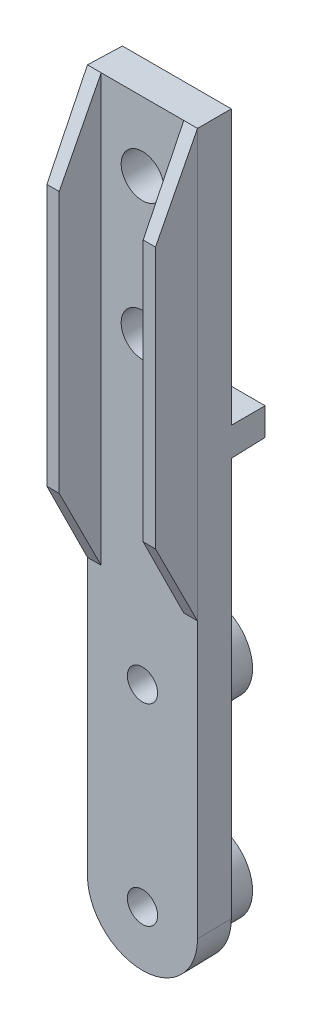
ISO-10303-21;
HEADER;
FILE_DESCRIPTION(('STEP AP214'),'2;1');
FILE_NAME('part.step','',(''),(''),'','','');
FILE_SCHEMA(('AUTOMOTIVE_DESIGN { 1 0 10303 214 1 1 1 1 }'));
ENDSEC;
DATA;
#1=APPLICATION_CONTEXT('core data for automotive mechanical design processes');
#2=APPLICATION_PROTOCOL_DEFINITION('international standard','automotive_design',2000,#1);
#3=PRODUCT_CONTEXT('',#1,'mechanical');
#4=PRODUCT('Part','Part','',(#3));
#5=PRODUCT_RELATED_PRODUCT_CATEGORY('part','',(#4));
#6=PRODUCT_DEFINITION_FORMATION('','',#4);
#7=PRODUCT_DEFINITION_CONTEXT('part definition',#1,'design');
#8=PRODUCT_DEFINITION('design','',#6,#7);
#9=PRODUCT_DEFINITION_SHAPE('','',#8);
#10=(LENGTH_UNIT() NAMED_UNIT(*) SI_UNIT(.MILLI.,.METRE.));
#11=(NAMED_UNIT(*) PLANE_ANGLE_UNIT() SI_UNIT($,.RADIAN.));
#12=(NAMED_UNIT(*) SI_UNIT($,.STERADIAN.) SOLID_ANGLE_UNIT());
#13=UNCERTAINTY_MEASURE_WITH_UNIT(LENGTH_MEASURE(1.E-05),#10,'distance_accuracy_value','');
#14=(GEOMETRIC_REPRESENTATION_CONTEXT(3) GLOBAL_UNCERTAINTY_ASSIGNED_CONTEXT((#13)) GLOBAL_UNIT_ASSIGNED_CONTEXT((#10,
#11,#12)) REPRESENTATION_CONTEXT('',''));
#15=CARTESIAN_POINT('',(0.,0.,0.));
#16=DIRECTION('',(0.,0.,1.));
#17=DIRECTION('',(1.,0.,0.));
#18=AXIS2_PLACEMENT_3D('',#15,#16,#17);
#19=CARTESIAN_POINT('',(18.9249,122.024306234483,0.));
#20=DIRECTION('',(0.,0.,-1.));
#21=DIRECTION('',(0.,1.,0.));
#22=AXIS2_PLACEMENT_3D('',#19,#20,#21);
#23=PLANE('',#22);
#24=CARTESIAN_POINT('',(14.925,107.024681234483,0.));
#25=DIRECTION('',(0.,0.,1.));
#26=DIRECTION('',(-1.,0.,0.));
#27=AXIS2_PLACEMENT_3D('',#24,#25,#26);
#28=CIRCLE('',#27,1.54996125);
#29=CARTESIAN_POINT('',(13.37503875,107.024681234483,0.));
#30=VERTEX_POINT('',#29);
#31=EDGE_CURVE('E320',#30,#30,#28,.T.);
#32=ORIENTED_EDGE('',*,*,#31,.F.);
#33=EDGE_LOOP('',(#32));
#34=FACE_BOUND('',#33,.T.);
#35=CARTESIAN_POINT('',(14.925,117.024431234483,0.));
#36=DIRECTION('',(0.,0.,1.));
#37=DIRECTION('',(-1.,0.,0.));
#38=AXIS2_PLACEMENT_3D('',#35,#36,#37);
#39=CIRCLE('',#38,1.54996125);
#40=CARTESIAN_POINT('',(13.37503875,117.024431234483,0.));
#41=VERTEX_POINT('',#40);
#42=EDGE_CURVE('E328',#41,#41,#39,.T.);
#43=ORIENTED_EDGE('',*,*,#42,.F.);
#44=EDGE_LOOP('',(#43));
#45=FACE_BOUND('',#44,.T.);
#46=CARTESIAN_POINT('',(14.925,85.0252312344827,0.));
#47=DIRECTION('',(0.,0.,1.));
#48=DIRECTION('',(1.,0.,0.));
#49=AXIS2_PLACEMENT_3D('',#46,#47,#48);
#50=CIRCLE('',#49,1.0999725);
#51=CARTESIAN_POINT('',(16.0249725,85.0252312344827,0.));
#52=VERTEX_POINT('',#51);
#53=EDGE_CURVE('E316',#52,#52,#50,.T.);
#54=ORIENTED_EDGE('',*,*,#53,.F.);
#55=EDGE_LOOP('',(#54));
#56=FACE_BOUND('',#55,.T.);
#57=CARTESIAN_POINT('',(14.925,71.0255812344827,0.));
#58=DIRECTION('',(0.,0.,1.));
#59=DIRECTION('',(1.,0.,0.));
#60=AXIS2_PLACEMENT_3D('',#57,#58,#59);
#61=CIRCLE('',#60,1.0999725);
#62=CARTESIAN_POINT('',(16.0249725,71.0255812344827,0.));
#63=VERTEX_POINT('',#62);
#64=EDGE_CURVE('E308',#63,#63,#61,.T.);
#65=ORIENTED_EDGE('',*,*,#64,.F.);
#66=EDGE_LOOP('',(#65));
#67=FACE_BOUND('',#66,.T.);
#68=DIRECTION('',(0.,-1.,0.));
#69=VECTOR('',#68,1.);
#70=CARTESIAN_POINT('',(11.925075,94.525,0.));
#71=LINE('',#70,#69);
#72=CARTESIAN_POINT('',(11.925075,91.0250812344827,0.));
#73=VERTEX_POINT('',#72);
#74=CARTESIAN_POINT('',(11.925075,122.024306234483,0.));
#75=VERTEX_POINT('',#74);
#76=EDGE_CURVE('E36',#73,#75,#71,.F.);
#77=ORIENTED_EDGE('',*,*,#76,.F.);
#78=DIRECTION('',(1.,0.,0.));
#79=VECTOR('',#78,1.);
#80=CARTESIAN_POINT('',(11.925075,91.0250812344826,0.));
#81=LINE('',#80,#79);
#82=CARTESIAN_POINT('',(10.9251,91.0250812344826,0.));
#83=VERTEX_POINT('',#82);
#84=EDGE_CURVE('E42',#83,#73,#81,.T.);
#85=ORIENTED_EDGE('',*,*,#84,.F.);
#86=DIRECTION('',(0.,1.,0.));
#87=VECTOR('',#86,1.);
#88=CARTESIAN_POINT('',(10.9251,122.024306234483,0.));
#89=LINE('',#88,#87);
#90=CARTESIAN_POINT('',(10.9251,71.0155814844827,0.));
#91=VERTEX_POINT('',#90);
#92=EDGE_CURVE('E202',#83,#91,#89,.F.);
#93=ORIENTED_EDGE('',*,*,#92,.T.);
#94=CARTESIAN_POINT('',(14.91500025,71.0155814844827,0.));
#95=DIRECTION('',(0.,0.,-1.));
#96=DIRECTION('',(0.,1.,0.));
#97=AXIS2_PLACEMENT_3D('',#94,#95,#96);
#98=CIRCLE('',#97,3.98990025);
#99=CARTESIAN_POINT('',(14.91500025,67.0256812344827,0.));
#100=VERTEX_POINT('',#99);
#101=EDGE_CURVE('E342',#91,#100,#98,.F.);
#102=ORIENTED_EDGE('',*,*,#101,.T.);
#103=DIRECTION('',(1.,0.,0.));
#104=VECTOR('',#103,1.);
#105=CARTESIAN_POINT('',(18.9249,67.0256812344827,0.));
#106=LINE('',#105,#104);
#107=CARTESIAN_POINT('',(14.93499975,67.0256812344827,0.));
#108=VERTEX_POINT('',#107);
#109=EDGE_CURVE('E362',#108,#100,#106,.F.);
#110=ORIENTED_EDGE('',*,*,#109,.F.);
#111=CARTESIAN_POINT('',(14.93499975,71.0155814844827,0.));
#112=DIRECTION('',(0.,0.,-1.));
#113=DIRECTION('',(0.,1.,0.));
#114=AXIS2_PLACEMENT_3D('',#111,#112,#113);
#115=CIRCLE('',#114,3.98990025);
#116=CARTESIAN_POINT('',(18.9249,71.0155814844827,0.));
#117=VERTEX_POINT('',#116);
#118=EDGE_CURVE('E337',#108,#117,#115,.F.);
#119=ORIENTED_EDGE('',*,*,#118,.T.);
#120=DIRECTION('',(0.,-1.,0.));
#121=VECTOR('',#120,1.);
#122=CARTESIAN_POINT('',(18.9249,122.024306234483,0.));
#123=LINE('',#122,#121);
#124=CARTESIAN_POINT('',(18.9249,91.0250812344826,0.));
#125=VERTEX_POINT('',#124);
#126=EDGE_CURVE('E352',#125,#117,#123,.T.);
#127=ORIENTED_EDGE('',*,*,#126,.F.);
#128=DIRECTION('',(1.,0.,0.));
#129=VECTOR('',#128,1.);
#130=CARTESIAN_POINT('',(17.924925,91.0250812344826,0.));
#131=LINE('',#130,#129);
#132=CARTESIAN_POINT('',(17.924925,91.0250812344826,0.));
#133=VERTEX_POINT('',#132);
#134=EDGE_CURVE('E20',#133,#125,#131,.T.);
#135=ORIENTED_EDGE('',*,*,#134,.F.);
#136=DIRECTION('',(0.,1.,0.));
#137=VECTOR('',#136,1.);
#138=CARTESIAN_POINT('',(17.924925,94.525,0.));
#139=LINE('',#138,#137);
#140=CARTESIAN_POINT('',(17.924925,122.024306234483,0.));
#141=VERTEX_POINT('',#140);
#142=EDGE_CURVE('E300',#141,#133,#139,.F.);
#143=ORIENTED_EDGE('',*,*,#142,.F.);
#144=DIRECTION('',(1.,0.,0.));
#145=VECTOR('',#144,1.);
#146=CARTESIAN_POINT('',(18.9249,122.024306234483,0.));
#147=LINE('',#146,#145);
#148=EDGE_CURVE('E396',#141,#75,#147,.F.);
#149=ORIENTED_EDGE('',*,*,#148,.T.);
#150=EDGE_LOOP('',(#77,#85,#93,#102,#110,#119,#127,#135,#143,#149));
#151=FACE_BOUND('',#150,.T.);
#152=ADVANCED_FACE('F16',(#34,#45,#56,#67,#151),#23,.F.);
#153=CARTESIAN_POINT('',(18.9249,122.024306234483,0.));
#154=DIRECTION('',(0.999847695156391,0.,-0.0174524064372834));
#155=DIRECTION('',(-0.0174524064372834,0.,-0.999847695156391));
#156=AXIS2_PLACEMENT_3D('',#153,#154,#155);
#157=PLANE('',#156);
#158=DIRECTION('',(-0.0174497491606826,-0.0174497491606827,-0.999695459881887));
#159=VECTOR('',#158,1.);
#160=CARTESIAN_POINT('',(18.9249,122.024306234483,0.));
#161=LINE('',#160,#159);
#162=CARTESIAN_POINT('',(18.881263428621,121.980669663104,-2.4999375));
#163=VERTEX_POINT('',#162);
#164=CARTESIAN_POINT('',(18.9249,122.024306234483,0.));
#165=VERTEX_POINT('',#164);
#166=EDGE_CURVE('E349',#163,#165,#161,.F.);
#167=ORIENTED_EDGE('',*,*,#166,.T.);
#168=EDGE_CURVE('E383',#165,#125,#123,.T.);
#169=ORIENTED_EDGE('',*,*,#168,.T.);
#170=ORIENTED_EDGE('',*,*,#126,.T.);
#171=DIRECTION('',(0.0174524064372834,0.,0.999847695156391));
#172=VECTOR('',#171,1.);
#173=CARTESIAN_POINT('',(18.9249,71.0155814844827,0.));
#174=LINE('',#173,#172);
#175=CARTESIAN_POINT('',(18.881263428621,71.0155814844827,-2.4999375));
#176=VERTEX_POINT('',#175);
#177=EDGE_CURVE('E367',#117,#176,#174,.F.);
#178=ORIENTED_EDGE('',*,*,#177,.T.);
#179=DIRECTION('',(0.,1.,0.));
#180=VECTOR('',#179,1.);
#181=CARTESIAN_POINT('',(18.881263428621,122.024306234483,-2.4999375));
#182=LINE('',#181,#180);
#183=CARTESIAN_POINT('',(18.881263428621,99.9812196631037,-2.4999375));
#184=VERTEX_POINT('',#183);
#185=EDGE_CURVE('E379',#176,#184,#182,.T.);
#186=ORIENTED_EDGE('',*,*,#185,.T.);
#187=DIRECTION('',(-0.0174497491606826,0.0174497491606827,-0.999695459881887));
#188=VECTOR('',#187,1.);
#189=CARTESIAN_POINT('',(18.9181747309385,99.9443083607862,-0.385290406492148));
#190=LINE('',#189,#188);
#191=CARTESIAN_POINT('',(18.837626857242,100.024856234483,-4.999875));
#192=VERTEX_POINT('',#191);
#193=EDGE_CURVE('E551',#192,#184,#190,.F.);
#194=ORIENTED_EDGE('',*,*,#193,.F.);
#195=DIRECTION('',(0.,-1.,0.));
#196=VECTOR('',#195,1.);
#197=CARTESIAN_POINT('',(18.837626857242,85.0252312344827,-4.999875));
#198=LINE('',#197,#196);
#199=CARTESIAN_POINT('',(18.837626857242,102.024806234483,-4.999875));
#200=VERTEX_POINT('',#199);
#201=EDGE_CURVE('E384',#200,#192,#198,.T.);
#202=ORIENTED_EDGE('',*,*,#201,.F.);
#203=DIRECTION('',(-0.0174497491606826,-0.0174497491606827,-0.999695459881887));
#204=VECTOR('',#203,1.);
#205=CARTESIAN_POINT('',(18.8364354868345,102.023614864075,-5.06812856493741));
#206=LINE('',#205,#204);
#207=CARTESIAN_POINT('',(18.881263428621,102.068442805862,-2.4999375));
#208=VERTEX_POINT('',#207);
#209=EDGE_CURVE('E561',#200,#208,#206,.F.);
#210=ORIENTED_EDGE('',*,*,#209,.T.);
#211=DIRECTION('',(0.,1.,0.));
#212=VECTOR('',#211,1.);
#213=CARTESIAN_POINT('',(18.881263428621,122.024306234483,-2.4999375));
#214=LINE('',#213,#212);
#215=EDGE_CURVE('E380',#208,#163,#214,.T.);
#216=ORIENTED_EDGE('',*,*,#215,.T.);
#217=EDGE_LOOP('',(#167,#169,#170,#178,#186,#194,#202,#210,#216));
#218=FACE_BOUND('',#217,.T.);
#219=ADVANCED_FACE('F886',(#218),#157,.T.);
#220=CARTESIAN_POINT('',(10.9251,122.024306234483,0.));
#221=DIRECTION('',(-0.999847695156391,0.,-0.0174524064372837));
#222=DIRECTION('',(-0.0174524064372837,0.,0.999847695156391));
#223=AXIS2_PLACEMENT_3D('',#220,#221,#222);
#224=PLANE('',#223);
#225=CARTESIAN_POINT('',(10.9251,122.024306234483,0.));
#226=VERTEX_POINT('',#225);
#227=EDGE_CURVE('E207',#226,#83,#89,.F.);
#228=ORIENTED_EDGE('',*,*,#227,.F.);
#229=DIRECTION('',(-0.0174497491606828,0.0174497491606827,0.999695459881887));
#230=VECTOR('',#229,1.);
#231=CARTESIAN_POINT('',(10.9275358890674,122.021870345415,-0.139551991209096));
#232=LINE('',#231,#230);
#233=CARTESIAN_POINT('',(10.968736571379,121.980669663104,-2.4999375));
#234=VERTEX_POINT('',#233);
#235=EDGE_CURVE('E189',#234,#226,#232,.T.);
#236=ORIENTED_EDGE('',*,*,#235,.F.);
#237=DIRECTION('',(0.,-1.,0.));
#238=VECTOR('',#237,1.);
#239=CARTESIAN_POINT('',(10.968736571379,122.024306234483,-2.4999375));
#240=LINE('',#239,#238);
#241=CARTESIAN_POINT('',(10.968736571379,102.068442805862,-2.4999375));
#242=VERTEX_POINT('',#241);
#243=EDGE_CURVE('E220',#242,#234,#240,.F.);
#244=ORIENTED_EDGE('',*,*,#243,.F.);
#245=DIRECTION('',(-0.0174497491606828,0.0174497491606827,0.999695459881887));
#246=VECTOR('',#245,1.);
#247=CARTESIAN_POINT('',(11.0135645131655,102.023614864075,-5.06812856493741));
#248=LINE('',#247,#246);
#249=CARTESIAN_POINT('',(11.012373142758,102.024806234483,-4.999875));
#250=VERTEX_POINT('',#249);
#251=EDGE_CURVE('E596',#250,#242,#248,.T.);
#252=ORIENTED_EDGE('',*,*,#251,.F.);
#253=DIRECTION('',(0.,-1.,0.));
#254=VECTOR('',#253,1.);
#255=CARTESIAN_POINT('',(11.012373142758,122.024306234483,-4.999875));
#256=LINE('',#255,#254);
#257=CARTESIAN_POINT('',(11.012373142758,100.024856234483,-4.999875));
#258=VERTEX_POINT('',#257);
#259=EDGE_CURVE('E370',#258,#250,#256,.F.);
#260=ORIENTED_EDGE('',*,*,#259,.F.);
#261=DIRECTION('',(-0.0174497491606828,-0.0174497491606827,0.999695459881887));
#262=VECTOR('',#261,1.);
#263=CARTESIAN_POINT('',(10.9318252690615,99.9443083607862,-0.385290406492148));
#264=LINE('',#263,#262);
#265=CARTESIAN_POINT('',(10.968736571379,99.9812196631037,-2.4999375));
#266=VERTEX_POINT('',#265);
#267=EDGE_CURVE('E764',#258,#266,#264,.T.);
#268=ORIENTED_EDGE('',*,*,#267,.T.);
#269=DIRECTION('',(0.,-1.,0.));
#270=VECTOR('',#269,1.);
#271=CARTESIAN_POINT('',(10.968736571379,122.024306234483,-2.4999375));
#272=LINE('',#271,#270);
#273=CARTESIAN_POINT('',(10.968736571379,71.0155814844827,-2.4999375));
#274=VERTEX_POINT('',#273);
#275=EDGE_CURVE('E353',#274,#266,#272,.F.);
#276=ORIENTED_EDGE('',*,*,#275,.F.);
#277=DIRECTION('',(-0.0174524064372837,0.,0.999847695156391));
#278=VECTOR('',#277,1.);
#279=CARTESIAN_POINT('',(10.9251,71.0155814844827,0.));
#280=LINE('',#279,#278);
#281=EDGE_CURVE('E341',#274,#91,#280,.T.);
#282=ORIENTED_EDGE('',*,*,#281,.T.);
#283=ORIENTED_EDGE('',*,*,#92,.F.);
#284=EDGE_LOOP('',(#228,#236,#244,#252,#260,#268,#276,#282,#283));
#285=FACE_BOUND('',#284,.T.);
#286=ADVANCED_FACE('F214',(#285),#224,.T.);
#287=CARTESIAN_POINT('',(18.9249,122.024306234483,-2.4999375));
#288=DIRECTION('',(0.,0.,1.));
#289=DIRECTION('',(-1.,0.,0.));
#290=AXIS2_PLACEMENT_3D('',#287,#288,#289);
#291=PLANE('',#290);
#292=CARTESIAN_POINT('',(14.925,107.024681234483,-2.4999375));
#293=DIRECTION('',(0.,0.,1.));
#294=DIRECTION('',(-1.,0.,0.));
#295=AXIS2_PLACEMENT_3D('',#292,#293,#294);
#296=CIRCLE('',#295,1.54996125);
#297=CARTESIAN_POINT('',(13.37503875,107.024681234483,-2.4999375));
#298=VERTEX_POINT('',#297);
#299=EDGE_CURVE('E324',#298,#298,#296,.T.);
#300=ORIENTED_EDGE('',*,*,#299,.T.);
#301=EDGE_LOOP('',(#300));
#302=FACE_BOUND('',#301,.T.);
#303=CARTESIAN_POINT('',(14.925,117.024431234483,-2.4999375));
#304=DIRECTION('',(0.,0.,1.));
#305=DIRECTION('',(-1.,0.,0.));
#306=AXIS2_PLACEMENT_3D('',#303,#304,#305);
#307=CIRCLE('',#306,1.54996125);
#308=CARTESIAN_POINT('',(13.37503875,117.024431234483,-2.4999375));
#309=VERTEX_POINT('',#308);
#310=EDGE_CURVE('E332',#309,#309,#307,.T.);
#311=ORIENTED_EDGE('',*,*,#310,.T.);
#312=EDGE_LOOP('',(#311));
#313=FACE_BOUND('',#312,.T.);
#314=DIRECTION('',(-1.,0.,0.));
#315=VECTOR('',#314,1.);
#316=CARTESIAN_POINT('',(18.9249,102.068442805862,-2.4999375));
#317=LINE('',#316,#315);
#318=EDGE_CURVE('E667',#242,#208,#317,.F.);
#319=ORIENTED_EDGE('',*,*,#318,.F.);
#320=ORIENTED_EDGE('',*,*,#243,.T.);
#321=DIRECTION('',(1.,0.,0.));
#322=VECTOR('',#321,1.);
#323=CARTESIAN_POINT('',(18.9249,121.980669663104,-2.4999375));
#324=LINE('',#323,#322);
#325=EDGE_CURVE('E197',#163,#234,#324,.F.);
#326=ORIENTED_EDGE('',*,*,#325,.F.);
#327=ORIENTED_EDGE('',*,*,#215,.F.);
#328=EDGE_LOOP('',(#319,#320,#326,#327));
#329=FACE_BOUND('',#328,.T.);
#330=ADVANCED_FACE('F890',(#302,#313,#329),#291,.F.);
#331=DIRECTION('',(1.,0.,0.));
#332=VECTOR('',#331,1.);
#333=CARTESIAN_POINT('',(18.9249,99.9812196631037,-2.4999375));
#334=LINE('',#333,#332);
#335=CARTESIAN_POINT('',(13.881388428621,99.9812196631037,-2.4999375));
#336=VERTEX_POINT('',#335);
#337=EDGE_CURVE('E653',#336,#266,#334,.F.);
#338=ORIENTED_EDGE('',*,*,#337,.F.);
#339=DIRECTION('',(0.,-1.,0.));
#340=VECTOR('',#339,1.);
#341=CARTESIAN_POINT('',(13.881388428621,122.024306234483,-2.4999375));
#342=LINE('',#341,#340);
#343=CARTESIAN_POINT('',(13.881388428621,87.8842768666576,-2.4999375));
#344=VERTEX_POINT('',#343);
#345=EDGE_CURVE('E11',#344,#336,#342,.F.);
#346=ORIENTED_EDGE('',*,*,#345,.F.);
#347=CARTESIAN_POINT('',(14.925,85.0252312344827,-2.4999375));
#348=DIRECTION('',(0.,0.,1.));
#349=DIRECTION('',(1.,0.,0.));
#350=AXIS2_PLACEMENT_3D('',#347,#348,#349);
#351=CIRCLE('',#350,3.04356157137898);
#352=CARTESIAN_POINT('',(13.881388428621,82.1661856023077,-2.4999375));
#353=VERTEX_POINT('',#352);
#354=EDGE_CURVE('E27',#353,#344,#351,.F.);
#355=ORIENTED_EDGE('',*,*,#354,.F.);
#356=DIRECTION('',(0.,-1.,0.));
#357=VECTOR('',#356,1.);
#358=CARTESIAN_POINT('',(13.881388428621,122.024306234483,-2.4999375));
#359=LINE('',#358,#357);
#360=CARTESIAN_POINT('',(13.881388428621,73.8846268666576,-2.4999375));
#361=VERTEX_POINT('',#360);
#362=EDGE_CURVE('E858',#361,#353,#359,.F.);
#363=ORIENTED_EDGE('',*,*,#362,.F.);
#364=CARTESIAN_POINT('',(14.925,71.0255812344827,-2.4999375));
#365=DIRECTION('',(0.,0.,1.));
#366=DIRECTION('',(1.,0.,0.));
#367=AXIS2_PLACEMENT_3D('',#364,#365,#366);
#368=CIRCLE('',#367,3.04356157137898);
#369=CARTESIAN_POINT('',(15.968611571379,73.8846268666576,-2.4999375));
#370=VERTEX_POINT('',#369);
#371=EDGE_CURVE('E867',#370,#361,#368,.F.);
#372=ORIENTED_EDGE('',*,*,#371,.F.);
#373=DIRECTION('',(0.,1.,0.));
#374=VECTOR('',#373,1.);
#375=CARTESIAN_POINT('',(15.968611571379,122.024306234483,-2.4999375));
#376=LINE('',#375,#374);
#377=CARTESIAN_POINT('',(15.968611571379,82.1661856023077,-2.4999375));
#378=VERTEX_POINT('',#377);
#379=EDGE_CURVE('E968',#378,#370,#376,.F.);
#380=ORIENTED_EDGE('',*,*,#379,.F.);
#381=CARTESIAN_POINT('',(14.925,85.0252312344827,-2.4999375));
#382=DIRECTION('',(0.,0.,1.));
#383=DIRECTION('',(1.,0.,0.));
#384=AXIS2_PLACEMENT_3D('',#381,#382,#383);
#385=CIRCLE('',#384,3.04356157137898);
#386=CARTESIAN_POINT('',(15.968611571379,87.8842768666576,-2.4999375));
#387=VERTEX_POINT('',#386);
#388=EDGE_CURVE('E972',#387,#378,#385,.F.);
#389=ORIENTED_EDGE('',*,*,#388,.F.);
#390=DIRECTION('',(0.,1.,0.));
#391=VECTOR('',#390,1.);
#392=CARTESIAN_POINT('',(15.968611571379,122.024306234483,-2.4999375));
#393=LINE('',#392,#391);
#394=CARTESIAN_POINT('',(15.968611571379,99.9812196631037,-2.4999375));
#395=VERTEX_POINT('',#394);
#396=EDGE_CURVE('E357',#395,#387,#393,.F.);
#397=ORIENTED_EDGE('',*,*,#396,.F.);
#398=DIRECTION('',(1.,0.,0.));
#399=VECTOR('',#398,1.);
#400=CARTESIAN_POINT('',(18.9249,99.9812196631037,-2.4999375));
#401=LINE('',#400,#399);
#402=EDGE_CURVE('E203',#184,#395,#401,.F.);
#403=ORIENTED_EDGE('',*,*,#402,.F.);
#404=ORIENTED_EDGE('',*,*,#185,.F.);
#405=CARTESIAN_POINT('',(14.93499975,71.0155814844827,-2.4999375));
#406=DIRECTION('',(0.,0.,1.));
#407=DIRECTION('',(1.,0.,0.));
#408=AXIS2_PLACEMENT_3D('',#405,#406,#407);
#409=CIRCLE('',#408,3.94626367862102);
#410=CARTESIAN_POINT('',(14.93499975,67.0693178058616,-2.4999375));
#411=VERTEX_POINT('',#410);
#412=EDGE_CURVE('E366',#176,#411,#409,.F.);
#413=ORIENTED_EDGE('',*,*,#412,.T.);
#414=DIRECTION('',(1.,0.,0.));
#415=VECTOR('',#414,1.);
#416=CARTESIAN_POINT('',(18.9249,67.0693178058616,-2.4999375));
#417=LINE('',#416,#415);
#418=CARTESIAN_POINT('',(14.91500025,67.0693178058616,-2.4999375));
#419=VERTEX_POINT('',#418);
#420=EDGE_CURVE('E358',#411,#419,#417,.F.);
#421=ORIENTED_EDGE('',*,*,#420,.T.);
#422=CARTESIAN_POINT('',(14.91500025,71.0155814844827,-2.4999375));
#423=DIRECTION('',(0.,0.,1.));
#424=DIRECTION('',(1.,0.,0.));
#425=AXIS2_PLACEMENT_3D('',#422,#423,#424);
#426=CIRCLE('',#425,3.94626367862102);
#427=EDGE_CURVE('E363',#419,#274,#426,.F.);
#428=ORIENTED_EDGE('',*,*,#427,.T.);
#429=ORIENTED_EDGE('',*,*,#275,.T.);
#430=EDGE_LOOP('',(#338,#346,#355,#363,#372,#380,#389,#397,#403,#404,#413,#421,#428,#429));
#431=FACE_BOUND('',#430,.T.);
#432=ADVANCED_FACE('F839',(#431),#291,.F.);
#433=CARTESIAN_POINT('',(18.9249,122.024306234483,0.));
#434=DIRECTION('',(0.,0.999847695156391,-0.0174524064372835));
#435=DIRECTION('',(0.,0.0174524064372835,0.999847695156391));
#436=AXIS2_PLACEMENT_3D('',#433,#434,#435);
#437=PLANE('',#436);
#438=ORIENTED_EDGE('',*,*,#235,.T.);
#439=DIRECTION('',(1.,0.,0.));
#440=VECTOR('',#439,1.);
#441=CARTESIAN_POINT('',(11.925075,122.024306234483,0.));
#442=LINE('',#441,#440);
#443=EDGE_CURVE('E194',#226,#75,#442,.T.);
#444=ORIENTED_EDGE('',*,*,#443,.T.);
#445=ORIENTED_EDGE('',*,*,#148,.F.);
#446=EDGE_CURVE('E484',#165,#141,#147,.F.);
#447=ORIENTED_EDGE('',*,*,#446,.F.);
#448=ORIENTED_EDGE('',*,*,#166,.F.);
#449=ORIENTED_EDGE('',*,*,#325,.T.);
#450=EDGE_LOOP('',(#438,#444,#445,#447,#448,#449));
#451=FACE_BOUND('',#450,.T.);
#452=ADVANCED_FACE('F191',(#451),#437,.T.);
#453=CARTESIAN_POINT('',(18.9249,67.0256812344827,0.));
#454=DIRECTION('',(0.,-0.999847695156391,-0.0174524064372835));
#455=DIRECTION('',(0.,0.0174524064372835,-0.999847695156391));
#456=AXIS2_PLACEMENT_3D('',#453,#454,#455);
#457=PLANE('',#456);
#458=ORIENTED_EDGE('',*,*,#420,.F.);
#459=DIRECTION('',(0.,-0.0174524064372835,0.999847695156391));
#460=VECTOR('',#459,1.);
#461=CARTESIAN_POINT('',(14.93499975,67.0256812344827,0.));
#462=LINE('',#461,#460);
#463=EDGE_CURVE('E345',#411,#108,#462,.T.);
#464=ORIENTED_EDGE('',*,*,#463,.T.);
#465=ORIENTED_EDGE('',*,*,#109,.T.);
#466=DIRECTION('',(0.,-0.0174524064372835,0.999847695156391));
#467=VECTOR('',#466,1.);
#468=CARTESIAN_POINT('',(14.91500025,67.0256812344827,0.));
#469=LINE('',#468,#467);
#470=EDGE_CURVE('E348',#100,#419,#469,.F.);
#471=ORIENTED_EDGE('',*,*,#470,.T.);
#472=EDGE_LOOP('',(#458,#464,#465,#471));
#473=FACE_BOUND('',#472,.T.);
#474=ADVANCED_FACE('F1025',(#473),#457,.T.);
#475=CARTESIAN_POINT('',(14.93499975,71.0155814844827,0.));
#476=DIRECTION('',(0.,0.,1.));
#477=DIRECTION('',(-1.,0.,0.));
#478=AXIS2_PLACEMENT_3D('',#475,#476,#477);
#479=CONICAL_SURFACE('',#478,3.98990025,0.0174532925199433);
#480=ORIENTED_EDGE('',*,*,#118,.F.);
#481=ORIENTED_EDGE('',*,*,#463,.F.);
#482=ORIENTED_EDGE('',*,*,#412,.F.);
#483=ORIENTED_EDGE('',*,*,#177,.F.);
#484=EDGE_LOOP('',(#480,#481,#482,#483));
#485=FACE_BOUND('',#484,.T.);
#486=ADVANCED_FACE('F1037',(#485),#479,.T.);
#487=CARTESIAN_POINT('',(14.91500025,71.0155814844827,0.));
#488=DIRECTION('',(0.,0.,1.));
#489=DIRECTION('',(-1.,0.,0.));
#490=AXIS2_PLACEMENT_3D('',#487,#488,#489);
#491=CONICAL_SURFACE('',#490,3.98990025,0.0174532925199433);
#492=ORIENTED_EDGE('',*,*,#101,.F.);
#493=ORIENTED_EDGE('',*,*,#281,.F.);
#494=ORIENTED_EDGE('',*,*,#427,.F.);
#495=ORIENTED_EDGE('',*,*,#470,.F.);
#496=EDGE_LOOP('',(#492,#493,#494,#495));
#497=FACE_BOUND('',#496,.T.);
#498=ADVANCED_FACE('F948',(#497),#491,.T.);
#499=CARTESIAN_POINT('',(14.925,85.0252312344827,-4.999875));
#500=DIRECTION('',(0.,0.,1.));
#501=DIRECTION('',(-1.,0.,0.));
#502=AXIS2_PLACEMENT_3D('',#499,#500,#501);
#503=CONICAL_SURFACE('',#502,2.999925,0.0174532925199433);
#504=CARTESIAN_POINT('',(15.924975,87.8535876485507,-4.999875));
#505=CARTESIAN_POINT('',(15.9322477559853,87.8587301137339,-4.5832190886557));
#506=CARTESIAN_POINT('',(15.9395205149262,87.8638587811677,-4.1665630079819));
#507=CARTESIAN_POINT('',(15.9540660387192,87.8740885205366,-3.3332505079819));
#508=CARTESIAN_POINT('',(15.9613388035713,87.8791895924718,-2.9165940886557));
#509=CARTESIAN_POINT('',(15.968611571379,87.8842768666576,-2.4999375));
#510=B_SPLINE_CURVE_WITH_KNOTS('',3,(#504,#505,#506,#507,#508,#509),.UNSPECIFIED.,.F.,.F.,(4,2,
4),(0.,1.25025332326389,2.50050664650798),.UNSPECIFIED.);
#511=CARTESIAN_POINT('',(15.924975,87.8535876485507,-4.999875));
#512=VERTEX_POINT('',#511);
#513=EDGE_CURVE('E954',#512,#387,#510,.T.);
#514=ORIENTED_EDGE('',*,*,#513,.T.);
#515=ORIENTED_EDGE('',*,*,#388,.T.);
#516=CARTESIAN_POINT('',(15.924975,82.1968748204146,-4.999875));
#517=CARTESIAN_POINT('',(15.9322477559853,82.1917323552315,-4.5832190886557));
#518=CARTESIAN_POINT('',(15.9395205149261,82.1866036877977,-4.1665630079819));
#519=CARTESIAN_POINT('',(15.9540660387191,82.1763739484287,-3.3332505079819));
#520=CARTESIAN_POINT('',(15.9613388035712,82.1712728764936,-2.9165940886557));
#521=CARTESIAN_POINT('',(15.968611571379,82.1661856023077,-2.4999375));
#522=B_SPLINE_CURVE_WITH_KNOTS('',3,(#516,#517,#518,#519,#520,#521),.UNSPECIFIED.,.F.,.F.,(4,2,
4),(0.,1.25025332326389,2.50050664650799),.UNSPECIFIED.);
#523=CARTESIAN_POINT('',(15.924975,82.1968748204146,-4.999875));
#524=VERTEX_POINT('',#523);
#525=EDGE_CURVE('E680',#524,#378,#522,.T.);
#526=ORIENTED_EDGE('',*,*,#525,.F.);
#527=CARTESIAN_POINT('',(14.925,85.0252312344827,-4.999875));
#528=DIRECTION('',(0.,0.,-1.));
#529=DIRECTION('',(1.,0.,0.));
#530=AXIS2_PLACEMENT_3D('',#527,#528,#529);
#531=CIRCLE('',#530,2.999925);
#532=EDGE_CURVE('E336',#512,#524,#531,.T.);
#533=ORIENTED_EDGE('',*,*,#532,.F.);
#534=EDGE_LOOP('',(#514,#515,#526,#533));
#535=FACE_BOUND('',#534,.T.);
#536=ADVANCED_FACE('F942',(#535),#503,.T.);
#537=CARTESIAN_POINT('',(15.924975,85.0252312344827,-4.999875));
#538=DIRECTION('',(0.999847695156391,0.,-0.0174524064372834));
#539=DIRECTION('',(-0.0174524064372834,0.,-0.999847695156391));
#540=AXIS2_PLACEMENT_3D('',#537,#538,#539);
#541=PLANE('',#540);
#542=ORIENTED_EDGE('',*,*,#525,.T.);
#543=ORIENTED_EDGE('',*,*,#379,.T.);
#544=CARTESIAN_POINT('',(15.924975,73.8539376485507,-4.999875));
#545=CARTESIAN_POINT('',(15.9322477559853,73.8590801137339,-4.5832190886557));
#546=CARTESIAN_POINT('',(15.9395205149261,73.8642087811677,-4.1665630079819));
#547=CARTESIAN_POINT('',(15.9540660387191,73.8744385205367,-3.3332505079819));
#548=CARTESIAN_POINT('',(15.9613388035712,73.8795395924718,-2.9165940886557));
#549=CARTESIAN_POINT('',(15.968611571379,73.8846268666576,-2.4999375));
#550=B_SPLINE_CURVE_WITH_KNOTS('',3,(#544,#545,#546,#547,#548,#549),.UNSPECIFIED.,.F.,.F.,(4,2,
4),(0.,1.25025332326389,2.50050664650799),.UNSPECIFIED.);
#551=CARTESIAN_POINT('',(15.924975,73.8539376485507,-4.999875));
#552=VERTEX_POINT('',#551);
#553=EDGE_CURVE('E694',#552,#370,#550,.T.);
#554=ORIENTED_EDGE('',*,*,#553,.F.);
#555=DIRECTION('',(0.,1.,0.));
#556=VECTOR('',#555,1.);
#557=CARTESIAN_POINT('',(15.924975,85.0252312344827,-4.999875));
#558=LINE('',#557,#556);
#559=EDGE_CURVE('E983',#524,#552,#558,.F.);
#560=ORIENTED_EDGE('',*,*,#559,.F.);
#561=EDGE_LOOP('',(#542,#543,#554,#560));
#562=FACE_BOUND('',#561,.T.);
#563=ADVANCED_FACE('F939',(#562),#541,.T.);
#564=CARTESIAN_POINT('',(14.925,71.0255812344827,-4.999875));
#565=DIRECTION('',(0.,0.,1.));
#566=DIRECTION('',(-1.,0.,0.));
#567=AXIS2_PLACEMENT_3D('',#564,#565,#566);
#568=CONICAL_SURFACE('',#567,2.999925,0.0174532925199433);
#569=ORIENTED_EDGE('',*,*,#553,.T.);
#570=ORIENTED_EDGE('',*,*,#371,.T.);
#571=CARTESIAN_POINT('',(13.925025,73.8539376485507,-4.999875));
#572=CARTESIAN_POINT('',(13.9177522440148,73.8590801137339,-4.5832190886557));
#573=CARTESIAN_POINT('',(13.9104794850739,73.8642087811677,-4.1665630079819));
#574=CARTESIAN_POINT('',(13.8959339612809,73.8744385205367,-3.3332505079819));
#575=CARTESIAN_POINT('',(13.8886611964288,73.8795395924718,-2.9165940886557));
#576=CARTESIAN_POINT('',(13.881388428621,73.8846268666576,-2.4999375));
#577=B_SPLINE_CURVE_WITH_KNOTS('',3,(#571,#572,#573,#574,#575,#576),.UNSPECIFIED.,.F.,.F.,(4,2,
4),(0.,1.25025332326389,2.50050664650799),.UNSPECIFIED.);
#578=CARTESIAN_POINT('',(13.925025,73.8539376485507,-4.999875));
#579=VERTEX_POINT('',#578);
#580=EDGE_CURVE('E708',#579,#361,#577,.T.);
#581=ORIENTED_EDGE('',*,*,#580,.F.);
#582=CARTESIAN_POINT('',(14.925,71.0255812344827,-4.999875));
#583=DIRECTION('',(0.,0.,-1.));
#584=DIRECTION('',(1.,0.,0.));
#585=AXIS2_PLACEMENT_3D('',#582,#583,#584);
#586=CIRCLE('',#585,2.999925);
#587=EDGE_CURVE('E986',#552,#579,#586,.T.);
#588=ORIENTED_EDGE('',*,*,#587,.F.);
#589=EDGE_LOOP('',(#569,#570,#581,#588));
#590=FACE_BOUND('',#589,.T.);
#591=ADVANCED_FACE('F914',(#590),#568,.T.);
#592=CARTESIAN_POINT('',(13.925025,85.0252312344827,-4.999875));
#593=DIRECTION('',(-0.999847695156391,0.,-0.0174524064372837));
#594=DIRECTION('',(-0.0174524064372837,0.,0.999847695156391));
#595=AXIS2_PLACEMENT_3D('',#592,#593,#594);
#596=PLANE('',#595);
#597=ORIENTED_EDGE('',*,*,#580,.T.);
#598=ORIENTED_EDGE('',*,*,#362,.T.);
#599=CARTESIAN_POINT('',(13.925025,82.1968748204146,-4.999875));
#600=CARTESIAN_POINT('',(13.9177522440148,82.1917323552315,-4.5832190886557));
#601=CARTESIAN_POINT('',(13.9104794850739,82.1866036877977,-4.1665630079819));
#602=CARTESIAN_POINT('',(13.8959339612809,82.1763739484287,-3.3332505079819));
#603=CARTESIAN_POINT('',(13.8886611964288,82.1712728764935,-2.9165940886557));
#604=CARTESIAN_POINT('',(13.881388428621,82.1661856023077,-2.4999375));
#605=B_SPLINE_CURVE_WITH_KNOTS('',3,(#599,#600,#601,#602,#603,#604),.UNSPECIFIED.,.F.,.F.,(4,2,
4),(0.,1.25025332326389,2.50050664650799),.UNSPECIFIED.);
#606=CARTESIAN_POINT('',(13.925025,82.1968748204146,-4.999875));
#607=VERTEX_POINT('',#606);
#608=EDGE_CURVE('E722',#607,#353,#605,.T.);
#609=ORIENTED_EDGE('',*,*,#608,.F.);
#610=DIRECTION('',(0.,-1.,0.));
#611=VECTOR('',#610,1.);
#612=CARTESIAN_POINT('',(13.925025,85.0252312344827,-4.999875));
#613=LINE('',#612,#611);
#614=EDGE_CURVE('E987',#579,#607,#613,.F.);
#615=ORIENTED_EDGE('',*,*,#614,.F.);
#616=EDGE_LOOP('',(#597,#598,#609,#615));
#617=FACE_BOUND('',#616,.T.);
#618=ADVANCED_FACE('F917',(#617),#596,.T.);
#619=CARTESIAN_POINT('',(14.925,85.0252312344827,-4.999875));
#620=DIRECTION('',(0.,0.,1.));
#621=DIRECTION('',(-1.,0.,0.));
#622=AXIS2_PLACEMENT_3D('',#619,#620,#621);
#623=CONICAL_SURFACE('',#622,2.999925,0.0174532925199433);
#624=ORIENTED_EDGE('',*,*,#608,.T.);
#625=ORIENTED_EDGE('',*,*,#354,.T.);
#626=CARTESIAN_POINT('',(13.925025,87.8535876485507,-4.999875));
#627=CARTESIAN_POINT('',(13.9177522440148,87.8587301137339,-4.5832190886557));
#628=CARTESIAN_POINT('',(13.9104794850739,87.8638587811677,-4.1665630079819));
#629=CARTESIAN_POINT('',(13.8959339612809,87.8740885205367,-3.3332505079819));
#630=CARTESIAN_POINT('',(13.8886611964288,87.8791895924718,-2.9165940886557));
#631=CARTESIAN_POINT('',(13.881388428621,87.8842768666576,-2.4999375));
#632=B_SPLINE_CURVE_WITH_KNOTS('',3,(#626,#627,#628,#629,#630,#631),.UNSPECIFIED.,.F.,.F.,(4,2,
4),(0.,1.25025332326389,2.50050664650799),.UNSPECIFIED.);
#633=CARTESIAN_POINT('',(13.925025,87.8535876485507,-4.999875));
#634=VERTEX_POINT('',#633);
#635=EDGE_CURVE('E736',#634,#344,#632,.T.);
#636=ORIENTED_EDGE('',*,*,#635,.F.);
#637=CARTESIAN_POINT('',(14.925,85.0252312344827,-4.999875));
#638=DIRECTION('',(0.,0.,-1.));
#639=DIRECTION('',(1.,0.,0.));
#640=AXIS2_PLACEMENT_3D('',#637,#638,#639);
#641=CIRCLE('',#640,2.999925);
#642=EDGE_CURVE('E853',#607,#634,#641,.T.);
#643=ORIENTED_EDGE('',*,*,#642,.F.);
#644=EDGE_LOOP('',(#624,#625,#636,#643));
#645=FACE_BOUND('',#644,.T.);
#646=ADVANCED_FACE('F852',(#645),#623,.T.);
#647=CARTESIAN_POINT('',(13.925025,85.0252312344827,-4.999875));
#648=DIRECTION('',(-0.999847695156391,0.,-0.0174524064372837));
#649=DIRECTION('',(-0.0174524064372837,0.,0.999847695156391));
#650=AXIS2_PLACEMENT_3D('',#647,#648,#649);
#651=PLANE('',#650);
#652=ORIENTED_EDGE('',*,*,#635,.T.);
#653=ORIENTED_EDGE('',*,*,#345,.T.);
#654=DIRECTION('',(-0.0174497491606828,-0.0174497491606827,0.999695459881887));
#655=VECTOR('',#654,1.);
#656=CARTESIAN_POINT('',(13.9204577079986,100.020288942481,-4.73821501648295));
#657=LINE('',#656,#655);
#658=CARTESIAN_POINT('',(13.925025,100.024856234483,-4.999875));
#659=VERTEX_POINT('',#658);
#660=EDGE_CURVE('E750',#659,#336,#657,.T.);
#661=ORIENTED_EDGE('',*,*,#660,.F.);
#662=DIRECTION('',(0.,-1.,0.));
#663=VECTOR('',#662,1.);
#664=CARTESIAN_POINT('',(13.925025,85.0252312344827,-4.999875));
#665=LINE('',#664,#663);
#666=EDGE_CURVE('E826',#634,#659,#665,.F.);
#667=ORIENTED_EDGE('',*,*,#666,.F.);
#668=EDGE_LOOP('',(#652,#653,#661,#667));
#669=FACE_BOUND('',#668,.T.);
#670=ADVANCED_FACE('F843',(#669),#651,.T.);
#671=CARTESIAN_POINT('',(15.924975,85.0252312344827,-4.999875));
#672=DIRECTION('',(0.999847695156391,0.,-0.0174524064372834));
#673=DIRECTION('',(-0.0174524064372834,0.,-0.999847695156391));
#674=AXIS2_PLACEMENT_3D('',#671,#672,#673);
#675=PLANE('',#674);
#676=DIRECTION('',(0.0174497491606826,-0.0174497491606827,0.999695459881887));
#677=VECTOR('',#676,1.);
#678=CARTESIAN_POINT('',(15.9246705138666,100.025160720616,-5.01731899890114));
#679=LINE('',#678,#677);
#680=CARTESIAN_POINT('',(15.924975,100.024856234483,-4.999875));
#681=VERTEX_POINT('',#680);
#682=EDGE_CURVE('E562',#681,#395,#679,.T.);
#683=ORIENTED_EDGE('',*,*,#682,.T.);
#684=ORIENTED_EDGE('',*,*,#396,.T.);
#685=ORIENTED_EDGE('',*,*,#513,.F.);
#686=DIRECTION('',(0.,1.,0.));
#687=VECTOR('',#686,1.);
#688=CARTESIAN_POINT('',(15.924975,85.0252312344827,-4.999875));
#689=LINE('',#688,#687);
#690=EDGE_CURVE('E961',#681,#512,#689,.F.);
#691=ORIENTED_EDGE('',*,*,#690,.F.);
#692=EDGE_LOOP('',(#683,#684,#685,#691));
#693=FACE_BOUND('',#692,.T.);
#694=ADVANCED_FACE('F950',(#693),#675,.T.);
#695=CARTESIAN_POINT('',(14.925,100.024856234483,-4.999875));
#696=DIRECTION('',(0.,-0.999847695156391,-0.0174524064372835));
#697=DIRECTION('',(0.,0.0174524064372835,-0.999847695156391));
#698=AXIS2_PLACEMENT_3D('',#695,#696,#697);
#699=PLANE('',#698);
#700=ORIENTED_EDGE('',*,*,#193,.T.);
#701=ORIENTED_EDGE('',*,*,#402,.T.);
#702=ORIENTED_EDGE('',*,*,#682,.F.);
#703=DIRECTION('',(1.,0.,0.));
#704=VECTOR('',#703,1.);
#705=CARTESIAN_POINT('',(14.925,100.024856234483,-4.999875));
#706=LINE('',#705,#704);
#707=EDGE_CURVE('E387',#192,#681,#706,.F.);
#708=ORIENTED_EDGE('',*,*,#707,.F.);
#709=EDGE_LOOP('',(#700,#701,#702,#708));
#710=FACE_BOUND('',#709,.T.);
#711=ADVANCED_FACE('F18',(#710),#699,.T.);
#712=CARTESIAN_POINT('',(14.925,100.024856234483,-4.999875));
#713=DIRECTION('',(0.,-0.999847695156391,-0.0174524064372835));
#714=DIRECTION('',(0.,0.0174524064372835,-0.999847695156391));
#715=AXIS2_PLACEMENT_3D('',#712,#713,#714);
#716=PLANE('',#715);
#717=ORIENTED_EDGE('',*,*,#660,.T.);
#718=ORIENTED_EDGE('',*,*,#337,.T.);
#719=ORIENTED_EDGE('',*,*,#267,.F.);
#720=DIRECTION('',(1.,0.,0.));
#721=VECTOR('',#720,1.);
#722=CARTESIAN_POINT('',(14.925,100.024856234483,-4.999875));
#723=LINE('',#722,#721);
#724=EDGE_CURVE('E374',#659,#258,#723,.F.);
#725=ORIENTED_EDGE('',*,*,#724,.F.);
#726=EDGE_LOOP('',(#717,#718,#719,#725));
#727=FACE_BOUND('',#726,.T.);
#728=ADVANCED_FACE('F835',(#727),#716,.T.);
#729=CARTESIAN_POINT('',(14.925,102.024806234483,-4.999875));
#730=DIRECTION('',(0.,0.999847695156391,-0.0174524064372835));
#731=DIRECTION('',(0.,0.0174524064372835,0.999847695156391));
#732=AXIS2_PLACEMENT_3D('',#729,#730,#731);
#733=PLANE('',#732);
#734=ORIENTED_EDGE('',*,*,#251,.T.);
#735=ORIENTED_EDGE('',*,*,#318,.T.);
#736=ORIENTED_EDGE('',*,*,#209,.F.);
#737=DIRECTION('',(-1.,0.,0.));
#738=VECTOR('',#737,1.);
#739=CARTESIAN_POINT('',(14.925,102.024806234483,-4.999875));
#740=LINE('',#739,#738);
#741=EDGE_CURVE('E373',#250,#200,#740,.F.);
#742=ORIENTED_EDGE('',*,*,#741,.F.);
#743=EDGE_LOOP('',(#734,#735,#736,#742));
#744=FACE_BOUND('',#743,.T.);
#745=ADVANCED_FACE('F891',(#744),#733,.T.);
#746=CARTESIAN_POINT('',(14.925,85.0252312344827,-4.999875));
#747=DIRECTION('',(0.,0.,-1.));
#748=DIRECTION('',(1.,0.,0.));
#749=AXIS2_PLACEMENT_3D('',#746,#747,#748);
#750=PLANE('',#749);
#751=ORIENTED_EDGE('',*,*,#532,.T.);
#752=ORIENTED_EDGE('',*,*,#559,.T.);
#753=ORIENTED_EDGE('',*,*,#587,.T.);
#754=ORIENTED_EDGE('',*,*,#614,.T.);
#755=ORIENTED_EDGE('',*,*,#642,.T.);
#756=ORIENTED_EDGE('',*,*,#666,.T.);
#757=ORIENTED_EDGE('',*,*,#724,.T.);
#758=ORIENTED_EDGE('',*,*,#259,.T.);
#759=ORIENTED_EDGE('',*,*,#741,.T.);
#760=ORIENTED_EDGE('',*,*,#201,.T.);
#761=ORIENTED_EDGE('',*,*,#707,.T.);
#762=ORIENTED_EDGE('',*,*,#690,.T.);
#763=EDGE_LOOP('',(#751,#752,#753,#754,#755,#756,#757,#758,#759,#760,#761,#762));
#764=FACE_BOUND('',#763,.T.);
#765=CARTESIAN_POINT('',(14.925,85.0252312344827,-4.999875));
#766=DIRECTION('',(0.,0.,1.));
#767=DIRECTION('',(1.,0.,0.));
#768=AXIS2_PLACEMENT_3D('',#765,#766,#767);
#769=CIRCLE('',#768,1.0999725);
#770=CARTESIAN_POINT('',(16.0249725,85.0252312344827,-4.999875));
#771=VERTEX_POINT('',#770);
#772=EDGE_CURVE('E312',#771,#771,#769,.T.);
#773=ORIENTED_EDGE('',*,*,#772,.T.);
#774=EDGE_LOOP('',(#773));
#775=FACE_BOUND('',#774,.T.);
#776=CARTESIAN_POINT('',(14.925,71.0255812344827,-4.999875));
#777=DIRECTION('',(0.,0.,1.));
#778=DIRECTION('',(1.,0.,0.));
#779=AXIS2_PLACEMENT_3D('',#776,#777,#778);
#780=CIRCLE('',#779,1.0999725);
#781=CARTESIAN_POINT('',(16.0249725,71.0255812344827,-4.999875));
#782=VERTEX_POINT('',#781);
#783=EDGE_CURVE('E304',#782,#782,#780,.T.);
#784=ORIENTED_EDGE('',*,*,#783,.T.);
#785=EDGE_LOOP('',(#784));
#786=FACE_BOUND('',#785,.T.);
#787=ADVANCED_FACE('F822',(#764,#775,#786),#750,.T.);
#788=CARTESIAN_POINT('',(14.925,117.024431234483,-4.999875));
#789=DIRECTION('',(0.,0.,1.));
#790=DIRECTION('',(-1.,0.,0.));
#791=AXIS2_PLACEMENT_3D('',#788,#789,#790);
#792=CYLINDRICAL_SURFACE('',#791,1.54996125);
#793=ORIENTED_EDGE('',*,*,#42,.T.);
#794=EDGE_LOOP('',(#793));
#795=FACE_BOUND('',#794,.T.);
#796=ORIENTED_EDGE('',*,*,#310,.F.);
#797=EDGE_LOOP('',(#796));
#798=FACE_BOUND('',#797,.T.);
#799=ADVANCED_FACE('F1338',(#795,#798),#792,.F.);
#800=CARTESIAN_POINT('',(14.925,107.024681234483,-4.999875));
#801=DIRECTION('',(0.,0.,1.));
#802=DIRECTION('',(-1.,0.,0.));
#803=AXIS2_PLACEMENT_3D('',#800,#801,#802);
#804=CYLINDRICAL_SURFACE('',#803,1.54996125);
#805=ORIENTED_EDGE('',*,*,#31,.T.);
#806=EDGE_LOOP('',(#805));
#807=FACE_BOUND('',#806,.T.);
#808=ORIENTED_EDGE('',*,*,#299,.F.);
#809=EDGE_LOOP('',(#808));
#810=FACE_BOUND('',#809,.T.);
#811=ADVANCED_FACE('F1330',(#807,#810),#804,.F.);
#812=CARTESIAN_POINT('',(14.925,85.0252312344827,-4.999875));
#813=DIRECTION('',(0.,0.,1.));
#814=DIRECTION('',(-1.,0.,0.));
#815=AXIS2_PLACEMENT_3D('',#812,#813,#814);
#816=CYLINDRICAL_SURFACE('',#815,1.0999725);
#817=ORIENTED_EDGE('',*,*,#772,.F.);
#818=EDGE_LOOP('',(#817));
#819=FACE_BOUND('',#818,.T.);
#820=ORIENTED_EDGE('',*,*,#53,.T.);
#821=EDGE_LOOP('',(#820));
#822=FACE_BOUND('',#821,.T.);
#823=ADVANCED_FACE('F1322',(#819,#822),#816,.F.);
#824=CARTESIAN_POINT('',(14.925,71.0255812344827,-4.999875));
#825=DIRECTION('',(0.,0.,1.));
#826=DIRECTION('',(-1.,0.,0.));
#827=AXIS2_PLACEMENT_3D('',#824,#825,#826);
#828=CYLINDRICAL_SURFACE('',#827,1.0999725);
#829=ORIENTED_EDGE('',*,*,#783,.F.);
#830=EDGE_LOOP('',(#829));
#831=FACE_BOUND('',#830,.T.);
#832=ORIENTED_EDGE('',*,*,#64,.T.);
#833=EDGE_LOOP('',(#832));
#834=FACE_BOUND('',#833,.T.);
#835=ADVANCED_FACE('F1314',(#831,#834),#828,.F.);
#836=CARTESIAN_POINT('',(18.9249,91.0250812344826,2.999925));
#837=DIRECTION('',(0.,0.,1.));
#838=DIRECTION('',(0.,-1.,0.));
#839=AXIS2_PLACEMENT_3D('',#836,#837,#838);
#840=PLANE('',#839);
#841=DIRECTION('',(0.,1.,0.));
#842=VECTOR('',#841,1.);
#843=CARTESIAN_POINT('',(18.8725361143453,91.0250812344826,2.999925));
#844=LINE('',#843,#842);
#845=CARTESIAN_POINT('',(18.8725361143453,97.0249312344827,2.999925));
#846=VERTEX_POINT('',#845);
#847=CARTESIAN_POINT('',(18.8725361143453,116.024456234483,2.999925));
#848=VERTEX_POINT('',#847);
#849=EDGE_CURVE('E293',#846,#848,#844,.T.);
#850=ORIENTED_EDGE('',*,*,#849,.T.);
#851=DIRECTION('',(-1.,0.,0.));
#852=VECTOR('',#851,1.);
#853=CARTESIAN_POINT('',(17.924925,116.024456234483,2.999925));
#854=LINE('',#853,#852);
#855=CARTESIAN_POINT('',(17.9772888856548,116.024456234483,2.999925));
#856=VERTEX_POINT('',#855);
#857=EDGE_CURVE('E285',#848,#856,#854,.T.);
#858=ORIENTED_EDGE('',*,*,#857,.T.);
#859=DIRECTION('',(0.,1.,0.));
#860=VECTOR('',#859,1.);
#861=CARTESIAN_POINT('',(17.9772888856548,94.525,2.999925));
#862=LINE('',#861,#860);
#863=CARTESIAN_POINT('',(17.9772888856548,97.0249312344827,2.999925));
#864=VERTEX_POINT('',#863);
#865=EDGE_CURVE('E284',#856,#864,#862,.F.);
#866=ORIENTED_EDGE('',*,*,#865,.T.);
#867=DIRECTION('',(1.,0.,0.));
#868=VECTOR('',#867,1.);
#869=CARTESIAN_POINT('',(18.9249,97.0249312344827,2.999925));
#870=LINE('',#869,#868);
#871=EDGE_CURVE('E279',#864,#846,#870,.T.);
#872=ORIENTED_EDGE('',*,*,#871,.T.);
#873=EDGE_LOOP('',(#850,#858,#866,#872));
#874=FACE_BOUND('',#873,.T.);
#875=ADVANCED_FACE('F1307',(#874),#840,.T.);
#876=CARTESIAN_POINT('',(18.9249,97.0249312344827,2.999925));
#877=DIRECTION('',(0.,-0.447213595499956,0.894427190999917));
#878=DIRECTION('',(0.,-0.894427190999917,-0.447213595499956));
#879=AXIS2_PLACEMENT_3D('',#876,#877,#878);
#880=PLANE('',#879);
#881=DIRECTION('',(-0.00780590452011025,-0.894399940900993,-0.447199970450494));
#882=VECTOR('',#881,1.);
#883=CARTESIAN_POINT('',(17.977346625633,97.0315470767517,3.0032329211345));
#884=LINE('',#883,#882);
#885=EDGE_CURVE('E290',#133,#864,#884,.F.);
#886=ORIENTED_EDGE('',*,*,#885,.F.);
#887=ORIENTED_EDGE('',*,*,#134,.T.);
#888=DIRECTION('',(0.00780590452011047,-0.894399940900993,-0.447199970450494));
#889=VECTOR('',#888,1.);
#890=CARTESIAN_POINT('',(18.9004649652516,93.8248456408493,1.39988220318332));
#891=LINE('',#890,#889);
#892=EDGE_CURVE('E283',#846,#125,#891,.T.);
#893=ORIENTED_EDGE('',*,*,#892,.F.);
#894=ORIENTED_EDGE('',*,*,#871,.F.);
#895=EDGE_LOOP('',(#886,#887,#893,#894));
#896=FACE_BOUND('',#895,.T.);
#897=ADVANCED_FACE('F439',(#896),#880,.T.);
#898=CARTESIAN_POINT('',(18.9249,116.024456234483,2.999925));
#899=DIRECTION('',(0.,0.447213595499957,0.894427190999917));
#900=DIRECTION('',(0.,-0.894427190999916,0.447213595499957));
#901=AXIS2_PLACEMENT_3D('',#898,#899,#900);
#902=PLANE('',#901);
#903=DIRECTION('',(-0.00780590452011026,-0.894399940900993,0.447199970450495));
#904=VECTOR('',#903,1.);
#905=CARTESIAN_POINT('',(18.7329108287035,100.026201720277,10.9990522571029));
#906=LINE('',#905,#904);
#907=EDGE_CURVE('E301',#165,#848,#906,.T.);
#908=ORIENTED_EDGE('',*,*,#907,.F.);
#909=ORIENTED_EDGE('',*,*,#446,.T.);
#910=DIRECTION('',(0.00780590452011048,-0.894399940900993,0.447199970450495));
#911=VECTOR('',#910,1.);
#912=CARTESIAN_POINT('',(17.977346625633,116.017840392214,3.0032329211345));
#913=LINE('',#912,#911);
#914=EDGE_CURVE('E289',#856,#141,#913,.F.);
#915=ORIENTED_EDGE('',*,*,#914,.F.);
#916=ORIENTED_EDGE('',*,*,#857,.F.);
#917=EDGE_LOOP('',(#908,#909,#915,#916));
#918=FACE_BOUND('',#917,.T.);
#919=ADVANCED_FACE('F879',(#918),#902,.T.);
#920=CARTESIAN_POINT('',(17.924925,94.525,0.));
#921=DIRECTION('',(-0.999847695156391,0.,0.0174524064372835));
#922=DIRECTION('',(0.0174524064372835,0.,0.999847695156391));
#923=AXIS2_PLACEMENT_3D('',#920,#921,#922);
#924=PLANE('',#923);
#925=ORIENTED_EDGE('',*,*,#865,.F.);
#926=ORIENTED_EDGE('',*,*,#914,.T.);
#927=ORIENTED_EDGE('',*,*,#142,.T.);
#928=ORIENTED_EDGE('',*,*,#885,.T.);
#929=EDGE_LOOP('',(#925,#926,#927,#928));
#930=FACE_BOUND('',#929,.T.);
#931=ADVANCED_FACE('F1287',(#930),#924,.T.);
#932=CARTESIAN_POINT('',(18.9249,94.525,0.));
#933=DIRECTION('',(0.999847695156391,0.,0.0174524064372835));
#934=DIRECTION('',(0.0174524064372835,0.,-0.999847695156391));
#935=AXIS2_PLACEMENT_3D('',#932,#933,#934);
#936=PLANE('',#935);
#937=ORIENTED_EDGE('',*,*,#892,.T.);
#938=ORIENTED_EDGE('',*,*,#168,.F.);
#939=ORIENTED_EDGE('',*,*,#907,.T.);
#940=ORIENTED_EDGE('',*,*,#849,.F.);
#941=EDGE_LOOP('',(#937,#938,#939,#940));
#942=FACE_BOUND('',#941,.T.);
#943=ADVANCED_FACE('F433',(#942),#936,.T.);
#944=CARTESIAN_POINT('',(10.9251,94.525,0.));
#945=DIRECTION('',(-0.999847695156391,0.,0.0174524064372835));
#946=DIRECTION('',(0.0174524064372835,0.,0.999847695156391));
#947=AXIS2_PLACEMENT_3D('',#944,#945,#946);
#948=PLANE('',#947);
#949=ORIENTED_EDGE('',*,*,#227,.T.);
#950=DIRECTION('',(-0.00780590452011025,-0.894399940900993,-0.447199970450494));
#951=VECTOR('',#950,1.);
#952=CARTESIAN_POINT('',(10.977521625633,97.0315470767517,3.0032329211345));
#953=LINE('',#952,#951);
#954=CARTESIAN_POINT('',(10.9774638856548,97.0249312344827,2.999925));
#955=VERTEX_POINT('',#954);
#956=EDGE_CURVE('E232',#83,#955,#953,.F.);
#957=ORIENTED_EDGE('',*,*,#956,.T.);
#958=DIRECTION('',(0.,1.,0.));
#959=VECTOR('',#958,1.);
#960=CARTESIAN_POINT('',(10.9774638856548,94.525,2.999925));
#961=LINE('',#960,#959);
#962=CARTESIAN_POINT('',(10.9774638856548,116.024456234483,2.999925));
#963=VERTEX_POINT('',#962);
#964=EDGE_CURVE('E226',#963,#955,#961,.F.);
#965=ORIENTED_EDGE('',*,*,#964,.F.);
#966=DIRECTION('',(0.00780590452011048,-0.894399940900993,0.447199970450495));
#967=VECTOR('',#966,1.);
#968=CARTESIAN_POINT('',(10.977521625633,116.017840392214,3.0032329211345));
#969=LINE('',#968,#967);
#970=EDGE_CURVE('E223',#963,#226,#969,.F.);
#971=ORIENTED_EDGE('',*,*,#970,.T.);
#972=EDGE_LOOP('',(#949,#957,#965,#971));
#973=FACE_BOUND('',#972,.T.);
#974=ADVANCED_FACE('F224',(#973),#948,.T.);
#975=CARTESIAN_POINT('',(11.925075,94.525,0.));
#976=DIRECTION('',(0.999847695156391,0.,0.0174524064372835));
#977=DIRECTION('',(0.0174524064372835,0.,-0.999847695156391));
#978=AXIS2_PLACEMENT_3D('',#975,#976,#977);
#979=PLANE('',#978);
#980=ORIENTED_EDGE('',*,*,#76,.T.);
#981=DIRECTION('',(0.00780590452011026,0.894399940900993,-0.447199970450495));
#982=VECTOR('',#981,1.);
#983=CARTESIAN_POINT('',(11.8727143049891,116.024821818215,2.99974220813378));
#984=LINE('',#983,#982);
#985=CARTESIAN_POINT('',(11.8727111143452,116.024456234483,2.999925));
#986=VERTEX_POINT('',#985);
#987=EDGE_CURVE('E243',#75,#986,#984,.F.);
#988=ORIENTED_EDGE('',*,*,#987,.T.);
#989=DIRECTION('',(0.,-1.,0.));
#990=VECTOR('',#989,1.);
#991=CARTESIAN_POINT('',(11.8727111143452,94.525,2.999925));
#992=LINE('',#991,#990);
#993=CARTESIAN_POINT('',(11.8727111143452,97.0249312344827,2.999925));
#994=VERTEX_POINT('',#993);
#995=EDGE_CURVE('E259',#994,#986,#992,.F.);
#996=ORIENTED_EDGE('',*,*,#995,.F.);
#997=DIRECTION('',(-0.00780590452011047,0.894399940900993,0.447199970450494));
#998=VECTOR('',#997,1.);
#999=CARTESIAN_POINT('',(11.8727143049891,97.0245656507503,2.99974220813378));
#1000=LINE('',#999,#998);
#1001=EDGE_CURVE('E270',#994,#73,#1000,.F.);
#1002=ORIENTED_EDGE('',*,*,#1001,.T.);
#1003=EDGE_LOOP('',(#980,#988,#996,#1002));
#1004=FACE_BOUND('',#1003,.T.);
#1005=ADVANCED_FACE('F1266',(#1004),#979,.T.);
#1006=CARTESIAN_POINT('',(11.925075,122.024306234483,2.999925));
#1007=DIRECTION('',(0.,0.,1.));
#1008=DIRECTION('',(0.,-1.,0.));
#1009=AXIS2_PLACEMENT_3D('',#1006,#1007,#1008);
#1010=PLANE('',#1009);
#1011=ORIENTED_EDGE('',*,*,#995,.T.);
#1012=DIRECTION('',(-1.,0.,0.));
#1013=VECTOR('',#1012,1.);
#1014=CARTESIAN_POINT('',(10.9251,116.024456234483,2.999925));
#1015=LINE('',#1014,#1013);
#1016=EDGE_CURVE('E256',#986,#963,#1015,.T.);
#1017=ORIENTED_EDGE('',*,*,#1016,.T.);
#1018=ORIENTED_EDGE('',*,*,#964,.T.);
#1019=DIRECTION('',(1.,0.,0.));
#1020=VECTOR('',#1019,1.);
#1021=CARTESIAN_POINT('',(11.925075,97.0249312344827,2.999925));
#1022=LINE('',#1021,#1020);
#1023=EDGE_CURVE('E260',#955,#994,#1022,.T.);
#1024=ORIENTED_EDGE('',*,*,#1023,.T.);
#1025=EDGE_LOOP('',(#1011,#1017,#1018,#1024));
#1026=FACE_BOUND('',#1025,.T.);
#1027=ADVANCED_FACE('F1258',(#1026),#1010,.T.);
#1028=CARTESIAN_POINT('',(11.925075,97.0249312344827,2.999925));
#1029=DIRECTION('',(0.,-0.447213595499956,0.894427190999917));
#1030=DIRECTION('',(0.,-0.894427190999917,-0.447213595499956));
#1031=AXIS2_PLACEMENT_3D('',#1028,#1029,#1030);
#1032=PLANE('',#1031);
#1033=ORIENTED_EDGE('',*,*,#956,.F.);
#1034=ORIENTED_EDGE('',*,*,#84,.T.);
#1035=ORIENTED_EDGE('',*,*,#1001,.F.);
#1036=ORIENTED_EDGE('',*,*,#1023,.F.);
#1037=EDGE_LOOP('',(#1033,#1034,#1035,#1036));
#1038=FACE_BOUND('',#1037,.T.);
#1039=ADVANCED_FACE('F1251',(#1038),#1032,.T.);
#1040=CARTESIAN_POINT('',(11.925075,116.024456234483,2.999925));
#1041=DIRECTION('',(0.,0.447213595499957,0.894427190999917));
#1042=DIRECTION('',(0.,-0.894427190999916,0.447213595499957));
#1043=AXIS2_PLACEMENT_3D('',#1040,#1041,#1042);
#1044=PLANE('',#1043);
#1045=ORIENTED_EDGE('',*,*,#987,.F.);
#1046=ORIENTED_EDGE('',*,*,#443,.F.);
#1047=ORIENTED_EDGE('',*,*,#970,.F.);
#1048=ORIENTED_EDGE('',*,*,#1016,.F.);
#1049=EDGE_LOOP('',(#1045,#1046,#1047,#1048));
#1050=FACE_BOUND('',#1049,.T.);
#1051=ADVANCED_FACE('F241',(#1050),#1044,.T.);
#1052=CLOSED_SHELL('',(#152,#219,#286,#330,#432,#452,#474,#486,#498,#536,#563,#591,#618,#646,
#670,#694,#711,#728,#745,#787,#799,#811,#823,#835,#875,#897,#919,#931,#943,#974,#1005,#1027,
#1039,#1051));
#1053=MANIFOLD_SOLID_BREP('B1',#1052);
#1054=ADVANCED_BREP_SHAPE_REPRESENTATION('',(#18,#1053),#14);
#1055=SHAPE_DEFINITION_REPRESENTATION(#9,#1054);
ENDSEC;
END-ISO-10303-21;
